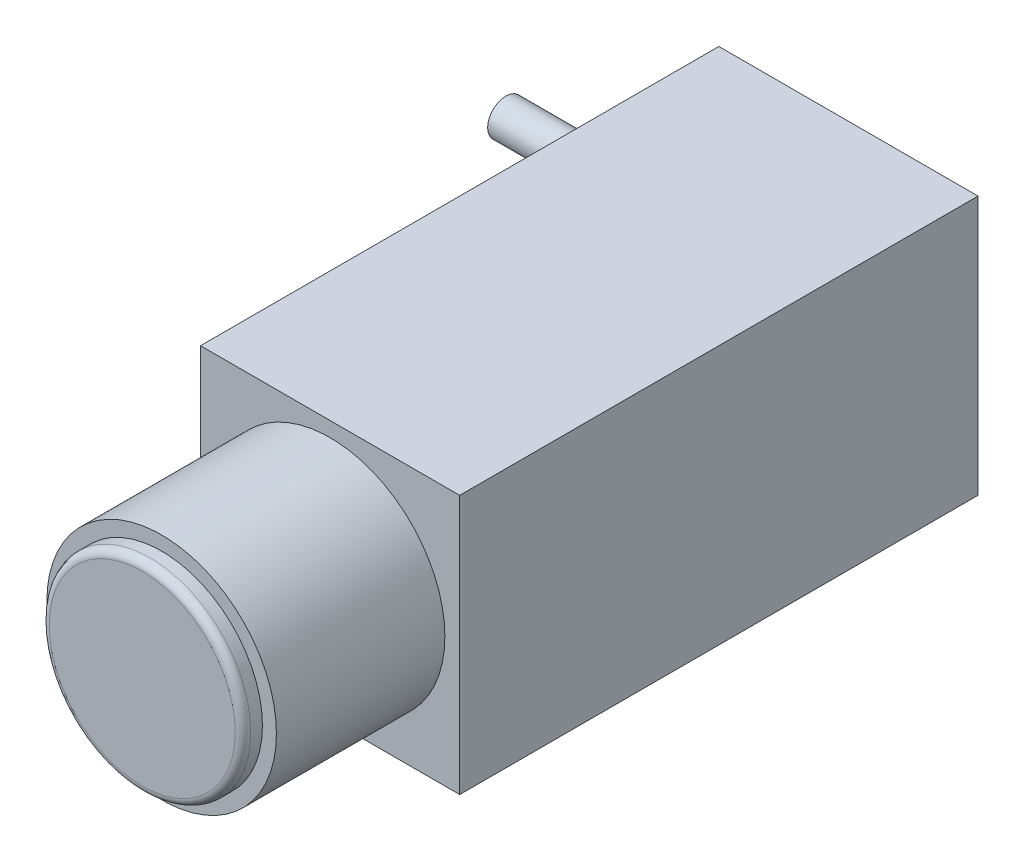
from build123d import *

# Parameters (mm, degrees)
SKETCH2_W           = 25.4
SKETCH2_H           = 25.4
BOSS_EXTRUDE1_DEPTH = 50.8
SKETCH3_R           = 11.249041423
BOSS_EXTRUDE2_DEPTH = 16.51
SKETCH4_R           = 9.8770028
BOSS_EXTRUDE3_DEPTH = 1.905
FILLET3_R           = 0.762
SKETCH6_R           = 1.778
BOSS_EXTRUDE4_DEPTH = 17.145


with BuildPart() as part:
    # Sketch2 → Boss-Extrude1 (new body)
    with BuildSketch(Plane.XY):
        with Locations((-12.7, 12.7)):
            Rectangle(SKETCH2_W, SKETCH2_H)
    extrude(amount=BOSS_EXTRUDE1_DEPTH)

    # Sketch3 → Boss-Extrude2 (add)
    with BuildSketch(Plane.XY.offset(50.8)):
        with Locations((-12.7, 12.7)):
            Circle(SKETCH3_R)
    extrude(amount=BOSS_EXTRUDE2_DEPTH)

    # Sketch4 → Boss-Extrude3 (add)
    with BuildSketch(Plane.XY.offset(67.31)):
        with Locations(Location((-12.7, 12.7, 0), (0, 0, 180))):
            Circle(SKETCH4_R)
    extrude(amount=BOSS_EXTRUDE3_DEPTH)

    # Fillet3
    fillet3_edges = [part.edges().sort_by_distance(p)[0] for p in [
        (-2.8229972, 12.7, 69.215),
    ]]
    fillet(fillet3_edges, radius=FILLET3_R)

    # Sketch6 → Boss-Extrude4 (add)
    with BuildSketch(Plane.ZY.offset(25.4)):
        with Locations(Location((3.734091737, 12.7, 0), (0, 0, 180))):
            Circle(SKETCH6_R)
    extrude(amount=BOSS_EXTRUDE4_DEPTH)


solid = part.part
